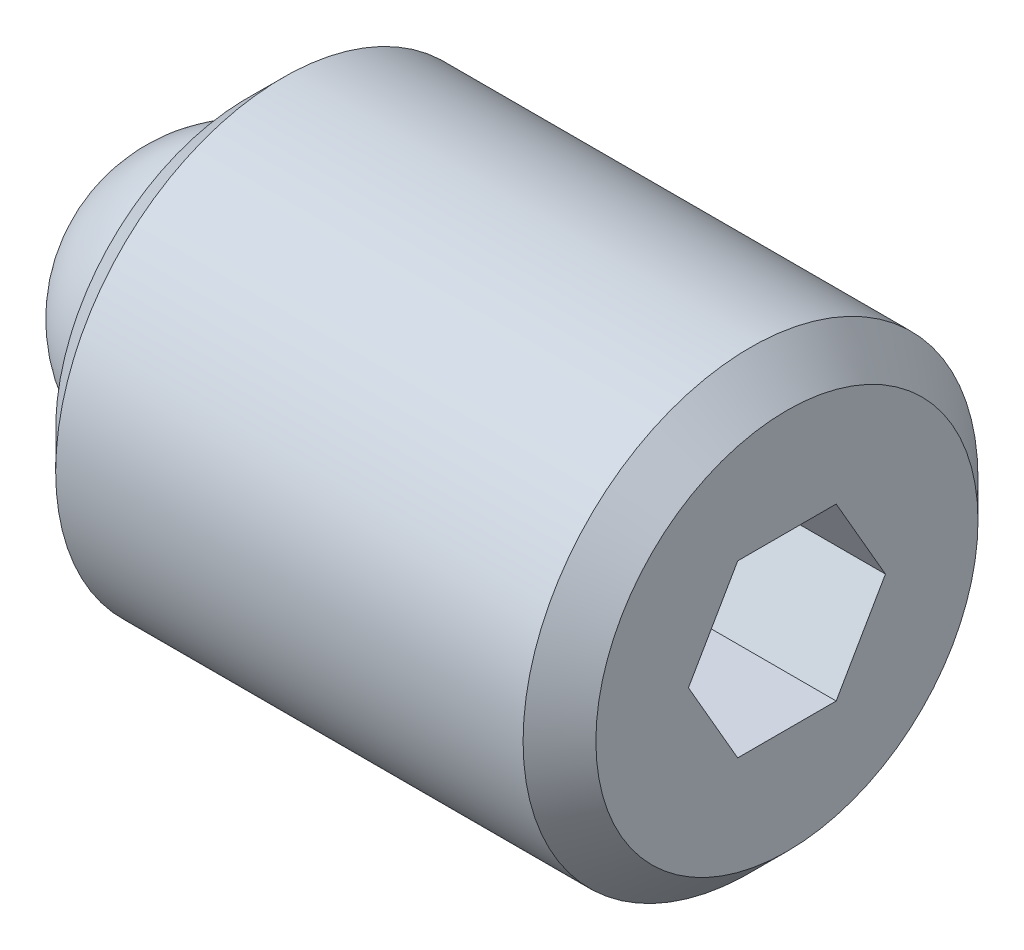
ISO-10303-21;
HEADER;
FILE_DESCRIPTION(('STEP AP214'),'2;1');
FILE_NAME('part.step','',(''),(''),'','','');
FILE_SCHEMA(('AUTOMOTIVE_DESIGN { 1 0 10303 214 1 1 1 1 }'));
ENDSEC;
DATA;
#1=APPLICATION_CONTEXT('core data for automotive mechanical design processes');
#2=APPLICATION_PROTOCOL_DEFINITION('international standard','automotive_design',2000,#1);
#3=PRODUCT_CONTEXT('',#1,'mechanical');
#4=PRODUCT('Part','Part','',(#3));
#5=PRODUCT_RELATED_PRODUCT_CATEGORY('part','',(#4));
#6=PRODUCT_DEFINITION_FORMATION('','',#4);
#7=PRODUCT_DEFINITION_CONTEXT('part definition',#1,'design');
#8=PRODUCT_DEFINITION('design','',#6,#7);
#9=PRODUCT_DEFINITION_SHAPE('','',#8);
#10=(LENGTH_UNIT() NAMED_UNIT(*) SI_UNIT(.MILLI.,.METRE.));
#11=(NAMED_UNIT(*) PLANE_ANGLE_UNIT() SI_UNIT($,.RADIAN.));
#12=(NAMED_UNIT(*) SI_UNIT($,.STERADIAN.) SOLID_ANGLE_UNIT());
#13=UNCERTAINTY_MEASURE_WITH_UNIT(LENGTH_MEASURE(1.E-05),#10,'distance_accuracy_value','');
#14=(GEOMETRIC_REPRESENTATION_CONTEXT(3) GLOBAL_UNCERTAINTY_ASSIGNED_CONTEXT((#13)) GLOBAL_UNIT_ASSIGNED_CONTEXT((#10,
#11,#12)) REPRESENTATION_CONTEXT('',''));
#15=CARTESIAN_POINT('',(0.,0.,0.));
#16=DIRECTION('',(0.,0.,1.));
#17=DIRECTION('',(1.,0.,0.));
#18=AXIS2_PLACEMENT_3D('',#15,#16,#17);
#19=CARTESIAN_POINT('',(0.,0.,0.));
#20=DIRECTION('',(0.,-1.,0.));
#21=DIRECTION('',(0.,0.,1.));
#22=AXIS2_PLACEMENT_3D('',#19,#20,#21);
#23=SPHERICAL_SURFACE('',#22,1.984375);
#24=CARTESIAN_POINT('',(0.,-1.984375,0.));
#25=VERTEX_POINT('',#24);
#26=VERTEX_LOOP('',#25);
#27=FACE_BOUND('',#26,.T.);
#28=ADVANCED_FACE('F41',(#27),#23,.T.);
#29=CLOSED_SHELL('',(#28));
#30=MANIFOLD_SOLID_BREP('B2',#29);
#31=CARTESIAN_POINT('',(7.540625,0.,0.));
#32=DIRECTION('',(-1.,0.,0.));
#33=DIRECTION('',(0.,0.,1.));
#34=AXIS2_PLACEMENT_3D('',#31,#32,#33);
#35=CYLINDRICAL_SURFACE('',#34,3.175);
#36=CARTESIAN_POINT('',(7.032625,0.,0.));
#37=DIRECTION('',(1.,0.,0.));
#38=DIRECTION('',(0.,0.,-1.));
#39=AXIS2_PLACEMENT_3D('',#36,#37,#38);
#40=CIRCLE('',#39,3.175);
#41=CARTESIAN_POINT('',(7.032625,0.,3.175));
#42=VERTEX_POINT('',#41);
#43=EDGE_CURVE('E39',#42,#42,#40,.F.);
#44=CARTESIAN_POINT('',(0.508000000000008,0.,0.));
#45=DIRECTION('',(1.,0.,0.));
#46=DIRECTION('',(0.,0.,-1.));
#47=AXIS2_PLACEMENT_3D('',#44,#45,#46);
#48=CIRCLE('',#47,3.175);
#49=CARTESIAN_POINT('',(0.508000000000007,0.,3.175));
#50=VERTEX_POINT('',#49);
#51=EDGE_CURVE('E157',#50,#50,#48,.T.);
#52=CARTESIAN_POINT('',(7.032625,0.,3.175));
#53=CARTESIAN_POINT('',(6.96466015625,0.,3.175));
#54=CARTESIAN_POINT('',(6.8966953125,0.,3.175));
#55=CARTESIAN_POINT('',(6.760765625,0.,3.175));
#56=CARTESIAN_POINT('',(6.69280078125,0.,3.175));
#57=CARTESIAN_POINT('',(6.55687109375,0.,3.175));
#58=CARTESIAN_POINT('',(6.48890625,0.,3.175));
#59=CARTESIAN_POINT('',(6.3529765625,0.,3.175));
#60=CARTESIAN_POINT('',(6.28501171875,0.,3.175));
#61=CARTESIAN_POINT('',(6.14908203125,0.,3.175));
#62=CARTESIAN_POINT('',(6.0811171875,0.,3.175));
#63=CARTESIAN_POINT('',(5.9451875,0.,3.175));
#64=CARTESIAN_POINT('',(5.87722265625,0.,3.175));
#65=CARTESIAN_POINT('',(5.74129296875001,0.,3.175));
#66=CARTESIAN_POINT('',(5.673328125,0.,3.175));
#67=CARTESIAN_POINT('',(5.5373984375,0.,3.175));
#68=CARTESIAN_POINT('',(5.46943359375,0.,3.175));
#69=CARTESIAN_POINT('',(5.33350390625,0.,3.175));
#70=CARTESIAN_POINT('',(5.2655390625,0.,3.175));
#71=CARTESIAN_POINT('',(5.129609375,0.,3.175));
#72=CARTESIAN_POINT('',(5.06164453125,0.,3.175));
#73=CARTESIAN_POINT('',(4.92571484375,0.,3.175));
#74=CARTESIAN_POINT('',(4.85775000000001,0.,3.175));
#75=CARTESIAN_POINT('',(4.72182031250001,0.,3.175));
#76=CARTESIAN_POINT('',(4.65385546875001,0.,3.175));
#77=CARTESIAN_POINT('',(4.51792578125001,0.,3.175));
#78=CARTESIAN_POINT('',(4.4499609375,0.,3.175));
#79=CARTESIAN_POINT('',(4.31403125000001,0.,3.175));
#80=CARTESIAN_POINT('',(4.24606640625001,0.,3.175));
#81=CARTESIAN_POINT('',(4.11013671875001,0.,3.175));
#82=CARTESIAN_POINT('',(4.042171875,0.,3.175));
#83=CARTESIAN_POINT('',(3.90624218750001,0.,3.175));
#84=CARTESIAN_POINT('',(3.83827734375,0.,3.175));
#85=CARTESIAN_POINT('',(3.70234765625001,0.,3.175));
#86=CARTESIAN_POINT('',(3.63438281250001,0.,3.175));
#87=CARTESIAN_POINT('',(3.49845312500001,0.,3.175));
#88=CARTESIAN_POINT('',(3.43048828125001,0.,3.175));
#89=CARTESIAN_POINT('',(3.29455859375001,0.,3.175));
#90=CARTESIAN_POINT('',(3.22659375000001,0.,3.175));
#91=CARTESIAN_POINT('',(3.09066406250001,0.,3.175));
#92=CARTESIAN_POINT('',(3.02269921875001,0.,3.175));
#93=CARTESIAN_POINT('',(2.88676953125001,0.,3.175));
#94=CARTESIAN_POINT('',(2.81880468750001,0.,3.175));
#95=CARTESIAN_POINT('',(2.68287500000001,0.,3.175));
#96=CARTESIAN_POINT('',(2.61491015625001,0.,3.175));
#97=CARTESIAN_POINT('',(2.47898046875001,0.,3.175));
#98=CARTESIAN_POINT('',(2.41101562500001,0.,3.175));
#99=CARTESIAN_POINT('',(2.27508593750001,0.,3.175));
#100=CARTESIAN_POINT('',(2.20712109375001,0.,3.175));
#101=CARTESIAN_POINT('',(2.07119140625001,0.,3.175));
#102=CARTESIAN_POINT('',(2.00322656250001,0.,3.175));
#103=CARTESIAN_POINT('',(1.86729687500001,0.,3.175));
#104=CARTESIAN_POINT('',(1.79933203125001,0.,3.175));
#105=CARTESIAN_POINT('',(1.66340234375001,0.,3.175));
#106=CARTESIAN_POINT('',(1.59543750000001,0.,3.175));
#107=CARTESIAN_POINT('',(1.45950781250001,0.,3.175));
#108=CARTESIAN_POINT('',(1.39154296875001,0.,3.175));
#109=CARTESIAN_POINT('',(1.25561328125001,0.,3.175));
#110=CARTESIAN_POINT('',(1.18764843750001,0.,3.175));
#111=CARTESIAN_POINT('',(1.05171875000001,0.,3.175));
#112=CARTESIAN_POINT('',(0.983753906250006,0.,3.175));
#113=CARTESIAN_POINT('',(0.847824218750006,0.,3.175));
#114=CARTESIAN_POINT('',(0.779859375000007,0.,3.175));
#115=CARTESIAN_POINT('',(0.643929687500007,0.,3.175));
#116=CARTESIAN_POINT('',(0.575964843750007,0.,3.175));
#117=CARTESIAN_POINT('',(0.508000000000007,0.,3.175));
#118=B_SPLINE_CURVE_WITH_KNOTS('',3,(#52,#53,#54,#55,#56,#57,#58,#59,#60,#61,#62,#63,#64,#65,
#66,#67,#68,#69,#70,#71,#72,#73,#74,#75,#76,#77,#78,#79,#80,#81,#82,#83,#84,#85,#86,#87,#88,#89,
#90,#91,#92,#93,#94,#95,#96,#97,#98,#99,#100,#101,#102,#103,#104,#105,#106,#107,#108,#109,#110,
#111,#112,#113,#114,#115,#116,#117),.UNSPECIFIED.,.F.,.F.,(4,2,2,2,2,2,2,2,2,2,2,2,2,2,2,2,2,2,
2,2,2,2,2,2,2,2,2,2,2,2,2,2,4),(0.,0.203894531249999,0.4077890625,0.61168359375,
0.815578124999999,1.01947265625,1.2233671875,1.42726171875,1.63115625,1.83505078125,
2.0389453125,2.24283984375,2.446734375,2.65062890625,2.8545234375,3.05841796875,3.2623125,
3.46620703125,3.6701015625,3.87399609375,4.077890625,4.28178515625,4.4856796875,4.68957421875,
4.89346875,5.09736328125,5.3012578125,5.50515234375,5.709046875,5.91294140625,6.1168359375,
6.32073046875,6.524625),.UNSPECIFIED.);
#119=EDGE_CURVE('BSEAM54',#42,#50,#118,.T.);
#120=ORIENTED_EDGE('',*,*,#43,.T.);
#121=ORIENTED_EDGE('',*,*,#51,.T.);
#122=ORIENTED_EDGE('',*,*,#119,.T.);
#123=ORIENTED_EDGE('',*,*,#119,.F.);
#124=EDGE_LOOP('',(#120,#122,#121,#123));
#125=FACE_BOUND('',#124,.T.);
#126=ADVANCED_FACE('F54',(#125),#35,.T.);
#127=CARTESIAN_POINT('',(7.540625,0.,0.));
#128=DIRECTION('',(1.,0.,0.));
#129=DIRECTION('',(0.,0.,-1.));
#130=AXIS2_PLACEMENT_3D('',#127,#128,#129);
#131=PLANE('',#130);
#132=DIRECTION('',(0.,0.866025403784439,-0.5));
#133=VECTOR('',#132,1.);
#134=CARTESIAN_POINT('',(7.540625,-1.190625,-0.687407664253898));
#135=LINE('',#134,#133);
#136=CARTESIAN_POINT('',(7.540625,-1.190625,-0.687407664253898));
#137=VERTEX_POINT('',#136);
#138=CARTESIAN_POINT('',(7.540625,0.,-1.3748153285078));
#139=VERTEX_POINT('',#138);
#140=EDGE_CURVE('E69',#137,#139,#135,.T.);
#141=ORIENTED_EDGE('',*,*,#140,.F.);
#142=DIRECTION('',(0.,0.,-1.));
#143=VECTOR('',#142,1.);
#144=CARTESIAN_POINT('',(7.540625,-1.190625,0.687407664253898));
#145=LINE('',#144,#143);
#146=CARTESIAN_POINT('',(7.540625,-1.190625,0.687407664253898));
#147=VERTEX_POINT('',#146);
#148=EDGE_CURVE('E153',#147,#137,#145,.T.);
#149=ORIENTED_EDGE('',*,*,#148,.F.);
#150=DIRECTION('',(0.,-0.866025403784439,-0.5));
#151=VECTOR('',#150,1.);
#152=CARTESIAN_POINT('',(7.540625,0.,1.3748153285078));
#153=LINE('',#152,#151);
#154=CARTESIAN_POINT('',(7.540625,0.,1.3748153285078));
#155=VERTEX_POINT('',#154);
#156=EDGE_CURVE('E151',#155,#147,#153,.T.);
#157=ORIENTED_EDGE('',*,*,#156,.F.);
#158=DIRECTION('',(0.,-0.866025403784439,0.5));
#159=VECTOR('',#158,1.);
#160=CARTESIAN_POINT('',(7.540625,1.190625,0.687407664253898));
#161=LINE('',#160,#159);
#162=CARTESIAN_POINT('',(7.540625,1.190625,0.687407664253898));
#163=VERTEX_POINT('',#162);
#164=EDGE_CURVE('E117',#163,#155,#161,.T.);
#165=ORIENTED_EDGE('',*,*,#164,.F.);
#166=DIRECTION('',(0.,0.,1.));
#167=VECTOR('',#166,1.);
#168=CARTESIAN_POINT('',(7.540625,1.190625,-0.687407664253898));
#169=LINE('',#168,#167);
#170=CARTESIAN_POINT('',(7.540625,1.190625,-0.687407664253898));
#171=VERTEX_POINT('',#170);
#172=EDGE_CURVE('E147',#171,#163,#169,.T.);
#173=ORIENTED_EDGE('',*,*,#172,.F.);
#174=DIRECTION('',(0.,0.866025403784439,0.5));
#175=VECTOR('',#174,1.);
#176=CARTESIAN_POINT('',(7.540625,0.,-1.3748153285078));
#177=LINE('',#176,#175);
#178=EDGE_CURVE('E143',#139,#171,#177,.T.);
#179=ORIENTED_EDGE('',*,*,#178,.F.);
#180=EDGE_LOOP('',(#141,#149,#157,#165,#173,#179));
#181=FACE_BOUND('',#180,.T.);
#182=CARTESIAN_POINT('',(7.540625,0.,0.));
#183=DIRECTION('',(1.,0.,0.));
#184=DIRECTION('',(0.,0.,-1.));
#185=AXIS2_PLACEMENT_3D('',#182,#183,#184);
#186=CIRCLE('',#185,2.66700000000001);
#187=CARTESIAN_POINT('',(7.540625,0.,-2.66700000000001));
#188=VERTEX_POINT('',#187);
#189=EDGE_CURVE('E62',#188,#188,#186,.T.);
#190=ORIENTED_EDGE('',*,*,#189,.T.);
#191=EDGE_LOOP('',(#190));
#192=FACE_BOUND('',#191,.T.);
#193=ADVANCED_FACE('F170',(#181,#192),#131,.T.);
#194=CARTESIAN_POINT('',(0.,0.,0.));
#195=DIRECTION('',(1.,0.,0.));
#196=DIRECTION('',(0.,0.,-1.));
#197=AXIS2_PLACEMENT_3D('',#194,#195,#196);
#198=PLANE('',#197);
#199=CARTESIAN_POINT('',(0.,0.,0.));
#200=DIRECTION('',(-1.,0.,0.));
#201=DIRECTION('',(0.,0.,1.));
#202=AXIS2_PLACEMENT_3D('',#199,#200,#201);
#203=CIRCLE('',#202,1.9812);
#204=CARTESIAN_POINT('',(0.,0.,1.9812));
#205=VERTEX_POINT('',#204);
#206=EDGE_CURVE('E225',#205,#205,#203,.T.);
#207=ORIENTED_EDGE('',*,*,#206,.F.);
#208=EDGE_LOOP('',(#207));
#209=FACE_BOUND('',#208,.T.);
#210=CARTESIAN_POINT('',(0.,0.,0.));
#211=DIRECTION('',(1.,0.,0.));
#212=DIRECTION('',(0.,0.,-1.));
#213=AXIS2_PLACEMENT_3D('',#210,#211,#212);
#214=CIRCLE('',#213,2.66699999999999);
#215=CARTESIAN_POINT('',(0.,0.,-2.66699999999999));
#216=VERTEX_POINT('',#215);
#217=EDGE_CURVE('E165',#216,#216,#214,.F.);
#218=ORIENTED_EDGE('',*,*,#217,.T.);
#219=EDGE_LOOP('',(#218));
#220=FACE_BOUND('',#219,.T.);
#221=ADVANCED_FACE('F182',(#209,#220),#198,.F.);
#222=CARTESIAN_POINT('',(0.508000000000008,0.,0.));
#223=DIRECTION('',(1.,0.,0.));
#224=DIRECTION('',(0.,0.,-1.));
#225=AXIS2_PLACEMENT_3D('',#222,#223,#224);
#226=CONICAL_SURFACE('',#225,3.175,0.78539816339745);
#227=ORIENTED_EDGE('',*,*,#217,.F.);
#228=EDGE_LOOP('',(#227));
#229=FACE_BOUND('',#228,.T.);
#230=ORIENTED_EDGE('',*,*,#51,.F.);
#231=EDGE_LOOP('',(#230));
#232=FACE_BOUND('',#231,.T.);
#233=ADVANCED_FACE('F174',(#229,#232),#226,.T.);
#234=CARTESIAN_POINT('',(7.540625,0.,0.));
#235=DIRECTION('',(-1.,0.,0.));
#236=DIRECTION('',(0.,0.,1.));
#237=AXIS2_PLACEMENT_3D('',#234,#235,#236);
#238=CONICAL_SURFACE('',#237,2.66700000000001,0.785398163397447);
#239=ORIENTED_EDGE('',*,*,#43,.F.);
#240=EDGE_LOOP('',(#239));
#241=FACE_BOUND('',#240,.T.);
#242=ORIENTED_EDGE('',*,*,#189,.F.);
#243=EDGE_LOOP('',(#242));
#244=FACE_BOUND('',#243,.T.);
#245=ADVANCED_FACE('F56',(#241,#244),#238,.T.);
#246=CARTESIAN_POINT('',(5.254625,-1.190625,-0.687407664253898));
#247=DIRECTION('',(0.,-0.5,-0.866025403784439));
#248=DIRECTION('',(0.,0.866025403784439,-0.5));
#249=AXIS2_PLACEMENT_3D('',#246,#247,#248);
#250=PLANE('',#249);
#251=ORIENTED_EDGE('',*,*,#140,.T.);
#252=DIRECTION('',(1.,0.,0.));
#253=VECTOR('',#252,1.);
#254=CARTESIAN_POINT('',(5.254625,0.,-1.3748153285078));
#255=LINE('',#254,#253);
#256=CARTESIAN_POINT('',(5.254625,0.,-1.3748153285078));
#257=VERTEX_POINT('',#256);
#258=EDGE_CURVE('E99',#257,#139,#255,.T.);
#259=ORIENTED_EDGE('',*,*,#258,.F.);
#260=DIRECTION('',(0.,0.866025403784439,-0.5));
#261=VECTOR('',#260,1.);
#262=CARTESIAN_POINT('',(5.254625,-1.190625,-0.687407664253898));
#263=LINE('',#262,#261);
#264=CARTESIAN_POINT('',(5.254625,-1.190625,-0.687407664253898));
#265=VERTEX_POINT('',#264);
#266=EDGE_CURVE('E155',#265,#257,#263,.T.);
#267=ORIENTED_EDGE('',*,*,#266,.F.);
#268=DIRECTION('',(1.,0.,0.));
#269=VECTOR('',#268,1.);
#270=CARTESIAN_POINT('',(5.254625,-1.190625,-0.687407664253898));
#271=LINE('',#270,#269);
#272=EDGE_CURVE('E77',#265,#137,#271,.T.);
#273=ORIENTED_EDGE('',*,*,#272,.T.);
#274=EDGE_LOOP('',(#251,#259,#267,#273));
#275=FACE_BOUND('',#274,.T.);
#276=ADVANCED_FACE('F173',(#275),#250,.F.);
#277=CARTESIAN_POINT('',(5.254625,-1.190625,0.687407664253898));
#278=DIRECTION('',(0.,-1.,0.));
#279=DIRECTION('',(0.,0.,-1.));
#280=AXIS2_PLACEMENT_3D('',#277,#278,#279);
#281=PLANE('',#280);
#282=ORIENTED_EDGE('',*,*,#148,.T.);
#283=ORIENTED_EDGE('',*,*,#272,.F.);
#284=DIRECTION('',(0.,0.,-1.));
#285=VECTOR('',#284,1.);
#286=CARTESIAN_POINT('',(5.254625,-1.190625,0.687407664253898));
#287=LINE('',#286,#285);
#288=CARTESIAN_POINT('',(5.254625,-1.190625,0.687407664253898));
#289=VERTEX_POINT('',#288);
#290=EDGE_CURVE('E129',#289,#265,#287,.T.);
#291=ORIENTED_EDGE('',*,*,#290,.F.);
#292=DIRECTION('',(1.,0.,0.));
#293=VECTOR('',#292,1.);
#294=CARTESIAN_POINT('',(5.254625,-1.190625,0.687407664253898));
#295=LINE('',#294,#293);
#296=EDGE_CURVE('E121',#289,#147,#295,.T.);
#297=ORIENTED_EDGE('',*,*,#296,.T.);
#298=EDGE_LOOP('',(#282,#283,#291,#297));
#299=FACE_BOUND('',#298,.T.);
#300=ADVANCED_FACE('F180',(#299),#281,.F.);
#301=CARTESIAN_POINT('',(5.254625,0.,1.3748153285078));
#302=DIRECTION('',(0.,-0.5,0.866025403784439));
#303=DIRECTION('',(0.,-0.866025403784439,-0.5));
#304=AXIS2_PLACEMENT_3D('',#301,#302,#303);
#305=PLANE('',#304);
#306=ORIENTED_EDGE('',*,*,#156,.T.);
#307=ORIENTED_EDGE('',*,*,#296,.F.);
#308=DIRECTION('',(0.,-0.866025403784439,-0.5));
#309=VECTOR('',#308,1.);
#310=CARTESIAN_POINT('',(5.254625,0.,1.3748153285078));
#311=LINE('',#310,#309);
#312=CARTESIAN_POINT('',(5.254625,0.,1.3748153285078));
#313=VERTEX_POINT('',#312);
#314=EDGE_CURVE('E125',#313,#289,#311,.T.);
#315=ORIENTED_EDGE('',*,*,#314,.F.);
#316=DIRECTION('',(1.,0.,0.));
#317=VECTOR('',#316,1.);
#318=CARTESIAN_POINT('',(5.254625,0.,1.3748153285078));
#319=LINE('',#318,#317);
#320=EDGE_CURVE('E110',#313,#155,#319,.T.);
#321=ORIENTED_EDGE('',*,*,#320,.T.);
#322=EDGE_LOOP('',(#306,#307,#315,#321));
#323=FACE_BOUND('',#322,.T.);
#324=ADVANCED_FACE('F126',(#323),#305,.F.);
#325=CARTESIAN_POINT('',(5.254625,1.190625,0.687407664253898));
#326=DIRECTION('',(0.,0.5,0.866025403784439));
#327=DIRECTION('',(0.,-0.866025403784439,0.5));
#328=AXIS2_PLACEMENT_3D('',#325,#326,#327);
#329=PLANE('',#328);
#330=ORIENTED_EDGE('',*,*,#164,.T.);
#331=ORIENTED_EDGE('',*,*,#320,.F.);
#332=DIRECTION('',(0.,-0.866025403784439,0.5));
#333=VECTOR('',#332,1.);
#334=CARTESIAN_POINT('',(5.254625,1.190625,0.687407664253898));
#335=LINE('',#334,#333);
#336=CARTESIAN_POINT('',(5.254625,1.190625,0.687407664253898));
#337=VERTEX_POINT('',#336);
#338=EDGE_CURVE('E114',#337,#313,#335,.T.);
#339=ORIENTED_EDGE('',*,*,#338,.F.);
#340=DIRECTION('',(1.,0.,0.));
#341=VECTOR('',#340,1.);
#342=CARTESIAN_POINT('',(5.254625,1.190625,0.687407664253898));
#343=LINE('',#342,#341);
#344=EDGE_CURVE('E122',#337,#163,#343,.T.);
#345=ORIENTED_EDGE('',*,*,#344,.T.);
#346=EDGE_LOOP('',(#330,#331,#339,#345));
#347=FACE_BOUND('',#346,.T.);
#348=ADVANCED_FACE('F112',(#347),#329,.F.);
#349=CARTESIAN_POINT('',(5.254625,1.190625,-0.687407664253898));
#350=DIRECTION('',(0.,1.,0.));
#351=DIRECTION('',(0.,0.,1.));
#352=AXIS2_PLACEMENT_3D('',#349,#350,#351);
#353=PLANE('',#352);
#354=ORIENTED_EDGE('',*,*,#172,.T.);
#355=ORIENTED_EDGE('',*,*,#344,.F.);
#356=DIRECTION('',(0.,0.,1.));
#357=VECTOR('',#356,1.);
#358=CARTESIAN_POINT('',(5.254625,1.190625,-0.687407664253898));
#359=LINE('',#358,#357);
#360=CARTESIAN_POINT('',(5.254625,1.190625,-0.687407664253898));
#361=VERTEX_POINT('',#360);
#362=EDGE_CURVE('E135',#361,#337,#359,.T.);
#363=ORIENTED_EDGE('',*,*,#362,.F.);
#364=DIRECTION('',(1.,0.,0.));
#365=VECTOR('',#364,1.);
#366=CARTESIAN_POINT('',(5.254625,1.190625,-0.687407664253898));
#367=LINE('',#366,#365);
#368=EDGE_CURVE('E160',#361,#171,#367,.T.);
#369=ORIENTED_EDGE('',*,*,#368,.T.);
#370=EDGE_LOOP('',(#354,#355,#363,#369));
#371=FACE_BOUND('',#370,.T.);
#372=ADVANCED_FACE('F201',(#371),#353,.F.);
#373=CARTESIAN_POINT('',(5.254625,0.,-1.3748153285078));
#374=DIRECTION('',(0.,0.5,-0.866025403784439));
#375=DIRECTION('',(0.,0.866025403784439,0.5));
#376=AXIS2_PLACEMENT_3D('',#373,#374,#375);
#377=PLANE('',#376);
#378=ORIENTED_EDGE('',*,*,#178,.T.);
#379=ORIENTED_EDGE('',*,*,#368,.F.);
#380=DIRECTION('',(0.,0.866025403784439,0.5));
#381=VECTOR('',#380,1.);
#382=CARTESIAN_POINT('',(5.254625,0.,-1.3748153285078));
#383=LINE('',#382,#381);
#384=EDGE_CURVE('E137',#257,#361,#383,.T.);
#385=ORIENTED_EDGE('',*,*,#384,.F.);
#386=ORIENTED_EDGE('',*,*,#258,.T.);
#387=EDGE_LOOP('',(#378,#379,#385,#386));
#388=FACE_BOUND('',#387,.T.);
#389=ADVANCED_FACE('F198',(#388),#377,.F.);
#390=CARTESIAN_POINT('',(5.254625,0.,0.));
#391=DIRECTION('',(1.,0.,0.));
#392=DIRECTION('',(0.,0.,-1.));
#393=AXIS2_PLACEMENT_3D('',#390,#391,#392);
#394=PLANE('',#393);
#395=ORIENTED_EDGE('',*,*,#266,.T.);
#396=ORIENTED_EDGE('',*,*,#384,.T.);
#397=ORIENTED_EDGE('',*,*,#362,.T.);
#398=ORIENTED_EDGE('',*,*,#338,.T.);
#399=ORIENTED_EDGE('',*,*,#314,.T.);
#400=ORIENTED_EDGE('',*,*,#290,.T.);
#401=EDGE_LOOP('',(#395,#396,#397,#398,#399,#400));
#402=FACE_BOUND('',#401,.T.);
#403=ADVANCED_FACE('F132',(#402),#394,.T.);
#404=CARTESIAN_POINT('',(1.984375,0.,0.));
#405=DIRECTION('',(-1.,0.,0.));
#406=DIRECTION('',(0.,0.,1.));
#407=AXIS2_PLACEMENT_3D('',#404,#405,#406);
#408=CYLINDRICAL_SURFACE('',#407,1.9812);
#409=CARTESIAN_POINT('',(1.984375,0.,0.));
#410=DIRECTION('',(-1.,0.,0.));
#411=DIRECTION('',(0.,0.,1.));
#412=AXIS2_PLACEMENT_3D('',#409,#410,#411);
#413=CIRCLE('',#412,1.9812);
#414=CARTESIAN_POINT('',(1.984375,0.,1.9812));
#415=VERTEX_POINT('',#414);
#416=EDGE_CURVE('E144',#415,#415,#413,.T.);
#417=ORIENTED_EDGE('',*,*,#416,.F.);
#418=EDGE_LOOP('',(#417));
#419=FACE_BOUND('',#418,.T.);
#420=ORIENTED_EDGE('',*,*,#206,.T.);
#421=EDGE_LOOP('',(#420));
#422=FACE_BOUND('',#421,.T.);
#423=ADVANCED_FACE('F214',(#419,#422),#408,.F.);
#424=CARTESIAN_POINT('',(1.984375,0.,0.));
#425=DIRECTION('',(-1.,0.,0.));
#426=DIRECTION('',(0.,0.,1.));
#427=AXIS2_PLACEMENT_3D('',#424,#425,#426);
#428=PLANE('',#427);
#429=ORIENTED_EDGE('',*,*,#416,.T.);
#430=EDGE_LOOP('',(#429));
#431=FACE_BOUND('',#430,.T.);
#432=ADVANCED_FACE('F217',(#431),#428,.T.);
#433=CLOSED_SHELL('',(#126,#193,#221,#233,#245,#276,#300,#324,#348,#372,#389,#403,#423,#432));
#434=MANIFOLD_SOLID_BREP('B6',#433);
#435=ADVANCED_BREP_SHAPE_REPRESENTATION('',(#18,#30,#434),#14);
#436=SHAPE_DEFINITION_REPRESENTATION(#9,#435);
ENDSEC;
END-ISO-10303-21;
